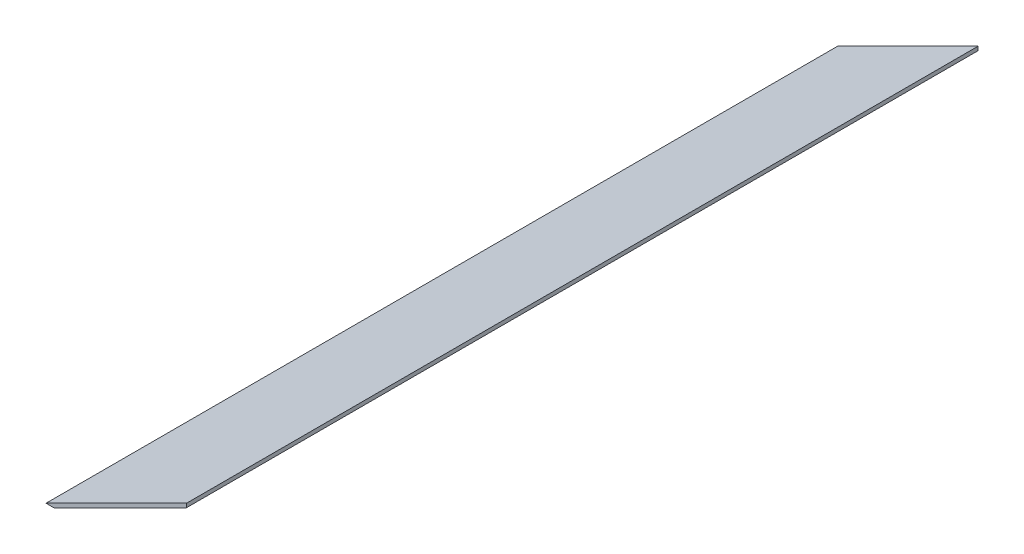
ISO-10303-21;
HEADER;
FILE_DESCRIPTION(('STEP AP214'),'2;1');
FILE_NAME('part.step','',(''),(''),'','','');
FILE_SCHEMA(('AUTOMOTIVE_DESIGN { 1 0 10303 214 1 1 1 1 }'));
ENDSEC;
DATA;
#1=APPLICATION_CONTEXT('core data for automotive mechanical design processes');
#2=APPLICATION_PROTOCOL_DEFINITION('international standard','automotive_design',2000,#1);
#3=PRODUCT_CONTEXT('',#1,'mechanical');
#4=PRODUCT('Part','Part','',(#3));
#5=PRODUCT_RELATED_PRODUCT_CATEGORY('part','',(#4));
#6=PRODUCT_DEFINITION_FORMATION('','',#4);
#7=PRODUCT_DEFINITION_CONTEXT('part definition',#1,'design');
#8=PRODUCT_DEFINITION('design','',#6,#7);
#9=PRODUCT_DEFINITION_SHAPE('','',#8);
#10=(LENGTH_UNIT() NAMED_UNIT(*) SI_UNIT(.MILLI.,.METRE.));
#11=(NAMED_UNIT(*) PLANE_ANGLE_UNIT() SI_UNIT($,.RADIAN.));
#12=(NAMED_UNIT(*) SI_UNIT($,.STERADIAN.) SOLID_ANGLE_UNIT());
#13=UNCERTAINTY_MEASURE_WITH_UNIT(LENGTH_MEASURE(1.E-05),#10,'distance_accuracy_value','');
#14=(GEOMETRIC_REPRESENTATION_CONTEXT(3) GLOBAL_UNCERTAINTY_ASSIGNED_CONTEXT((#13)) GLOBAL_UNIT_ASSIGNED_CONTEXT((#10,
#11,#12)) REPRESENTATION_CONTEXT('',''));
#15=CARTESIAN_POINT('',(0.,0.,0.));
#16=DIRECTION('',(0.,0.,1.));
#17=DIRECTION('',(1.,0.,0.));
#18=AXIS2_PLACEMENT_3D('',#15,#16,#17);
#19=CARTESIAN_POINT('',(11.1856188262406,8.79640222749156,226.));
#20=DIRECTION('',(-1.,0.,0.));
#21=DIRECTION('',(0.,0.,1.));
#22=AXIS2_PLACEMENT_3D('',#19,#20,#21);
#23=PLANE('',#22);
#24=DIRECTION('',(0.,1.,0.));
#25=VECTOR('',#24,1.);
#26=CARTESIAN_POINT('',(11.1856188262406,8.79640222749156,0.));
#27=LINE('',#26,#25);
#28=CARTESIAN_POINT('',(11.1856188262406,7.67836823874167,0.));
#29=VERTEX_POINT('',#28);
#30=CARTESIAN_POINT('',(11.1856188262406,8.79640222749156,0.));
#31=VERTEX_POINT('',#30);
#32=EDGE_CURVE('E98',#29,#31,#27,.T.);
#33=ORIENTED_EDGE('',*,*,#32,.T.);
#34=DIRECTION('',(0.,0.,-1.));
#35=VECTOR('',#34,1.);
#36=CARTESIAN_POINT('',(11.1856188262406,8.79640222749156,226.));
#37=LINE('',#36,#35);
#38=CARTESIAN_POINT('',(11.1856188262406,8.79640222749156,226.));
#39=VERTEX_POINT('',#38);
#40=EDGE_CURVE('E11',#39,#31,#37,.T.);
#41=ORIENTED_EDGE('',*,*,#40,.F.);
#42=DIRECTION('',(0.,1.,0.));
#43=VECTOR('',#42,1.);
#44=CARTESIAN_POINT('',(11.1856188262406,8.79640222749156,226.));
#45=LINE('',#44,#43);
#46=CARTESIAN_POINT('',(11.1856188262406,7.67836823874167,226.));
#47=VERTEX_POINT('',#46);
#48=EDGE_CURVE('E86',#47,#39,#45,.T.);
#49=ORIENTED_EDGE('',*,*,#48,.F.);
#50=DIRECTION('',(0.,0.,-1.));
#51=VECTOR('',#50,1.);
#52=CARTESIAN_POINT('',(11.1856188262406,7.67836823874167,226.));
#53=LINE('',#52,#51);
#54=EDGE_CURVE('E94',#47,#29,#53,.T.);
#55=ORIENTED_EDGE('',*,*,#54,.T.);
#56=EDGE_LOOP('',(#33,#41,#49,#55));
#57=FACE_BOUND('',#56,.T.);
#58=ADVANCED_FACE('F35',(#57),#23,.F.);
#59=CARTESIAN_POINT('',(-28.9221556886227,-11.2574850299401,226.));
#60=DIRECTION('',(0.447213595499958,-0.894427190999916,0.));
#61=DIRECTION('',(0.894427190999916,0.447213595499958,0.));
#62=AXIS2_PLACEMENT_3D('',#59,#60,#61);
#63=PLANE('',#62);
#64=DIRECTION('',(-0.894427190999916,-0.447213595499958,0.));
#65=VECTOR('',#64,1.);
#66=CARTESIAN_POINT('',(-28.9221556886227,-11.2574850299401,0.));
#67=LINE('',#66,#65);
#68=CARTESIAN_POINT('',(-28.9221556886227,-11.2574850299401,0.));
#69=VERTEX_POINT('',#68);
#70=EDGE_CURVE('E90',#31,#69,#67,.T.);
#71=ORIENTED_EDGE('',*,*,#70,.T.);
#72=DIRECTION('',(0.,0.,-1.));
#73=VECTOR('',#72,1.);
#74=CARTESIAN_POINT('',(-28.9221556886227,-11.2574850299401,226.));
#75=LINE('',#74,#73);
#76=CARTESIAN_POINT('',(-28.9221556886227,-11.2574850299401,226.));
#77=VERTEX_POINT('',#76);
#78=EDGE_CURVE('E43',#77,#69,#75,.T.);
#79=ORIENTED_EDGE('',*,*,#78,.F.);
#80=DIRECTION('',(-0.894427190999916,-0.447213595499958,0.));
#81=VECTOR('',#80,1.);
#82=CARTESIAN_POINT('',(-28.9221556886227,-11.2574850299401,226.));
#83=LINE('',#82,#81);
#84=EDGE_CURVE('E81',#39,#77,#83,.T.);
#85=ORIENTED_EDGE('',*,*,#84,.F.);
#86=ORIENTED_EDGE('',*,*,#40,.T.);
#87=EDGE_LOOP('',(#71,#79,#85,#86));
#88=FACE_BOUND('',#87,.T.);
#89=ADVANCED_FACE('F89',(#88),#63,.F.);
#90=CARTESIAN_POINT('',(-28.9221556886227,-11.2574850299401,226.));
#91=DIRECTION('',(0.,1.,0.));
#92=DIRECTION('',(0.,0.,1.));
#93=AXIS2_PLACEMENT_3D('',#90,#91,#92);
#94=PLANE('',#93);
#95=DIRECTION('',(1.,0.,0.));
#96=VECTOR('',#95,1.);
#97=CARTESIAN_POINT('',(-28.9221556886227,-11.2574850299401,0.));
#98=LINE('',#97,#96);
#99=CARTESIAN_POINT('',(-26.6860877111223,-11.2574850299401,0.));
#100=VERTEX_POINT('',#99);
#101=EDGE_CURVE('E68',#69,#100,#98,.T.);
#102=ORIENTED_EDGE('',*,*,#101,.T.);
#103=DIRECTION('',(0.,0.,-1.));
#104=VECTOR('',#103,1.);
#105=CARTESIAN_POINT('',(-26.6860877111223,-11.2574850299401,226.));
#106=LINE('',#105,#104);
#107=CARTESIAN_POINT('',(-26.6860877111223,-11.2574850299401,226.));
#108=VERTEX_POINT('',#107);
#109=EDGE_CURVE('E91',#108,#100,#106,.T.);
#110=ORIENTED_EDGE('',*,*,#109,.F.);
#111=DIRECTION('',(1.,0.,0.));
#112=VECTOR('',#111,1.);
#113=CARTESIAN_POINT('',(-28.9221556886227,-11.2574850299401,226.));
#114=LINE('',#113,#112);
#115=EDGE_CURVE('E84',#77,#108,#114,.T.);
#116=ORIENTED_EDGE('',*,*,#115,.F.);
#117=ORIENTED_EDGE('',*,*,#78,.T.);
#118=EDGE_LOOP('',(#102,#110,#116,#117));
#119=FACE_BOUND('',#118,.T.);
#120=ADVANCED_FACE('F92',(#119),#94,.F.);
#121=CARTESIAN_POINT('',(11.1856188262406,7.67836823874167,226.));
#122=DIRECTION('',(-0.447213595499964,0.894427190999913,0.));
#123=DIRECTION('',(-0.894427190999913,-0.447213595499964,0.));
#124=AXIS2_PLACEMENT_3D('',#121,#122,#123);
#125=PLANE('',#124);
#126=DIRECTION('',(0.894427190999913,0.447213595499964,0.));
#127=VECTOR('',#126,1.);
#128=CARTESIAN_POINT('',(11.1856188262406,7.67836823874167,0.));
#129=LINE('',#128,#127);
#130=EDGE_CURVE('E74',#100,#29,#129,.T.);
#131=ORIENTED_EDGE('',*,*,#130,.T.);
#132=ORIENTED_EDGE('',*,*,#54,.F.);
#133=DIRECTION('',(0.894427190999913,0.447213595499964,0.));
#134=VECTOR('',#133,1.);
#135=CARTESIAN_POINT('',(11.1856188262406,7.67836823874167,226.));
#136=LINE('',#135,#134);
#137=EDGE_CURVE('E51',#108,#47,#136,.T.);
#138=ORIENTED_EDGE('',*,*,#137,.F.);
#139=ORIENTED_EDGE('',*,*,#109,.T.);
#140=EDGE_LOOP('',(#131,#132,#138,#139));
#141=FACE_BOUND('',#140,.T.);
#142=ADVANCED_FACE('F105',(#141),#125,.F.);
#143=CARTESIAN_POINT('',(0.,0.,226.));
#144=DIRECTION('',(0.,0.,1.));
#145=DIRECTION('',(1.,0.,0.));
#146=AXIS2_PLACEMENT_3D('',#143,#144,#145);
#147=PLANE('',#146);
#148=ORIENTED_EDGE('',*,*,#48,.T.);
#149=ORIENTED_EDGE('',*,*,#84,.T.);
#150=ORIENTED_EDGE('',*,*,#115,.T.);
#151=ORIENTED_EDGE('',*,*,#137,.T.);
#152=EDGE_LOOP('',(#148,#149,#150,#151));
#153=FACE_BOUND('',#152,.T.);
#154=ADVANCED_FACE('F82',(#153),#147,.T.);
#155=CARTESIAN_POINT('',(0.,0.,0.));
#156=DIRECTION('',(0.,0.,1.));
#157=DIRECTION('',(1.,0.,0.));
#158=AXIS2_PLACEMENT_3D('',#155,#156,#157);
#159=PLANE('',#158);
#160=ORIENTED_EDGE('',*,*,#32,.F.);
#161=ORIENTED_EDGE('',*,*,#130,.F.);
#162=ORIENTED_EDGE('',*,*,#101,.F.);
#163=ORIENTED_EDGE('',*,*,#70,.F.);
#164=EDGE_LOOP('',(#160,#161,#162,#163));
#165=FACE_BOUND('',#164,.T.);
#166=ADVANCED_FACE('F108',(#165),#159,.F.);
#167=CLOSED_SHELL('',(#58,#89,#120,#142,#154,#166));
#168=MANIFOLD_SOLID_BREP('B2',#167);
#169=ADVANCED_BREP_SHAPE_REPRESENTATION('',(#18,#168),#14);
#170=SHAPE_DEFINITION_REPRESENTATION(#9,#169);
ENDSEC;
END-ISO-10303-21;
